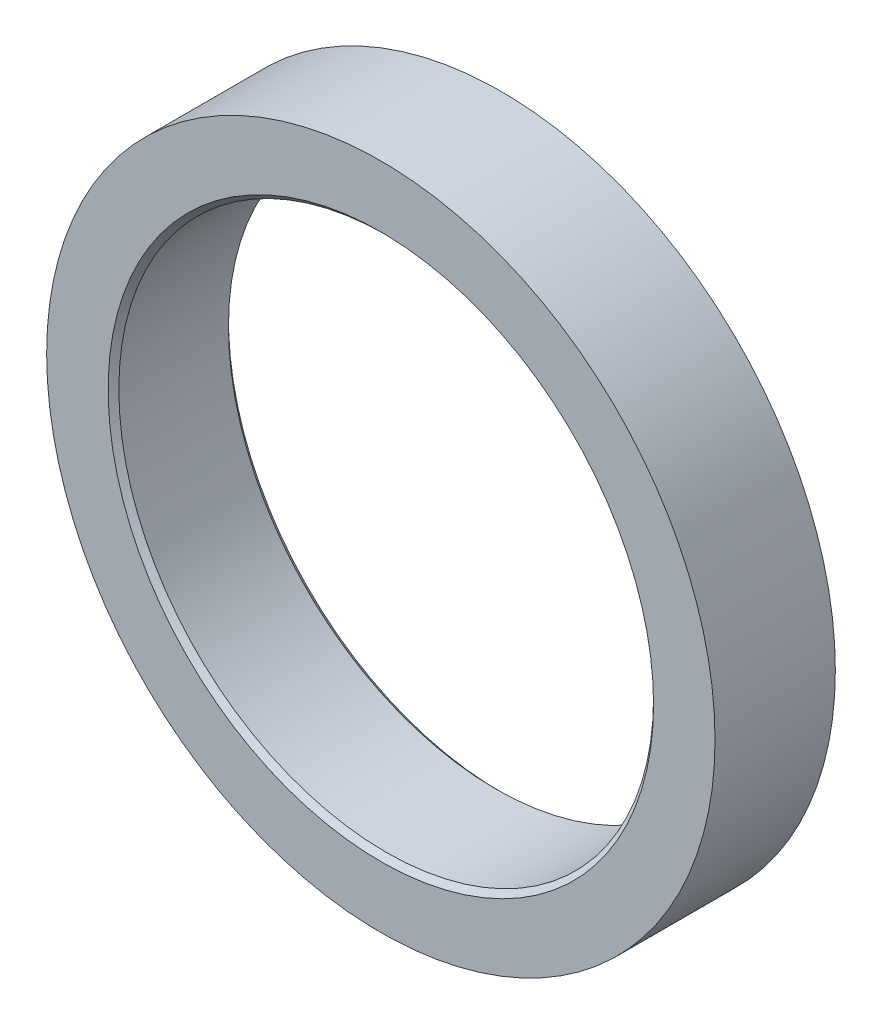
ISO-10303-21;
HEADER;
FILE_DESCRIPTION(('STEP AP214'),'2;1');
FILE_NAME('part.step','',(''),(''),'','','');
FILE_SCHEMA(('AUTOMOTIVE_DESIGN { 1 0 10303 214 1 1 1 1 }'));
ENDSEC;
DATA;
#1=APPLICATION_CONTEXT('core data for automotive mechanical design processes');
#2=APPLICATION_PROTOCOL_DEFINITION('international standard','automotive_design',2000,#1);
#3=PRODUCT_CONTEXT('',#1,'mechanical');
#4=PRODUCT('Part','Part','',(#3));
#5=PRODUCT_RELATED_PRODUCT_CATEGORY('part','',(#4));
#6=PRODUCT_DEFINITION_FORMATION('','',#4);
#7=PRODUCT_DEFINITION_CONTEXT('part definition',#1,'design');
#8=PRODUCT_DEFINITION('design','',#6,#7);
#9=PRODUCT_DEFINITION_SHAPE('','',#8);
#10=(LENGTH_UNIT() NAMED_UNIT(*) SI_UNIT(.MILLI.,.METRE.));
#11=(NAMED_UNIT(*) PLANE_ANGLE_UNIT() SI_UNIT($,.RADIAN.));
#12=(NAMED_UNIT(*) SI_UNIT($,.STERADIAN.) SOLID_ANGLE_UNIT());
#13=UNCERTAINTY_MEASURE_WITH_UNIT(LENGTH_MEASURE(1.E-05),#10,'distance_accuracy_value','');
#14=(GEOMETRIC_REPRESENTATION_CONTEXT(3) GLOBAL_UNCERTAINTY_ASSIGNED_CONTEXT((#13)) GLOBAL_UNIT_ASSIGNED_CONTEXT((#10,
#11,#12)) REPRESENTATION_CONTEXT('',''));
#15=CARTESIAN_POINT('',(0.,0.,0.));
#16=DIRECTION('',(0.,0.,1.));
#17=DIRECTION('',(1.,0.,0.));
#18=AXIS2_PLACEMENT_3D('',#15,#16,#17);
#19=CARTESIAN_POINT('',(0.,0.,4.5));
#20=DIRECTION('',(0.,0.,1.));
#21=DIRECTION('',(1.,0.,0.));
#22=AXIS2_PLACEMENT_3D('',#19,#20,#21);
#23=PLANE('',#22);
#24=CARTESIAN_POINT('',(0.,0.,4.5));
#25=DIRECTION('',(0.,0.,1.));
#26=DIRECTION('',(1.,0.,0.));
#27=AXIS2_PLACEMENT_3D('',#24,#25,#26);
#28=CIRCLE('',#27,10.2);
#29=CARTESIAN_POINT('',(10.2,0.,4.5));
#30=VERTEX_POINT('',#29);
#31=EDGE_CURVE('E10',#30,#30,#28,.F.);
#32=ORIENTED_EDGE('',*,*,#31,.T.);
#33=EDGE_LOOP('',(#32));
#34=FACE_BOUND('',#33,.T.);
#35=CARTESIAN_POINT('',(0.,0.,4.5));
#36=DIRECTION('',(0.,0.,1.));
#37=DIRECTION('',(1.,0.,0.));
#38=AXIS2_PLACEMENT_3D('',#35,#36,#37);
#39=CIRCLE('',#38,12.5);
#40=CARTESIAN_POINT('',(12.5,0.,4.5));
#41=VERTEX_POINT('',#40);
#42=EDGE_CURVE('E370',#41,#41,#39,.T.);
#43=ORIENTED_EDGE('',*,*,#42,.T.);
#44=EDGE_LOOP('',(#43));
#45=FACE_BOUND('',#44,.T.);
#46=ADVANCED_FACE('F350',(#34,#45),#23,.T.);
#47=CARTESIAN_POINT('',(0.,0.,0.));
#48=DIRECTION('',(0.,0.,1.));
#49=DIRECTION('',(1.,0.,0.));
#50=AXIS2_PLACEMENT_3D('',#47,#48,#49);
#51=PLANE('',#50);
#52=CARTESIAN_POINT('',(0.,0.,0.));
#53=DIRECTION('',(0.,0.,1.));
#54=DIRECTION('',(1.,0.,0.));
#55=AXIS2_PLACEMENT_3D('',#52,#53,#54);
#56=CIRCLE('',#55,10.2);
#57=CARTESIAN_POINT('',(10.2,0.,0.));
#58=VERTEX_POINT('',#57);
#59=EDGE_CURVE('E365',#58,#58,#56,.T.);
#60=ORIENTED_EDGE('',*,*,#59,.T.);
#61=EDGE_LOOP('',(#60));
#62=FACE_BOUND('',#61,.T.);
#63=CARTESIAN_POINT('',(0.,0.,0.));
#64=DIRECTION('',(0.,0.,1.));
#65=DIRECTION('',(1.,0.,0.));
#66=AXIS2_PLACEMENT_3D('',#63,#64,#65);
#67=CIRCLE('',#66,12.5);
#68=CARTESIAN_POINT('',(12.5,0.,0.));
#69=VERTEX_POINT('',#68);
#70=EDGE_CURVE('E373',#69,#69,#67,.T.);
#71=ORIENTED_EDGE('',*,*,#70,.F.);
#72=EDGE_LOOP('',(#71));
#73=FACE_BOUND('',#72,.T.);
#74=ADVANCED_FACE('F378',(#62,#73),#51,.F.);
#75=CARTESIAN_POINT('',(0.,0.,4.5));
#76=DIRECTION('',(0.,0.,-1.));
#77=DIRECTION('',(-1.,0.,0.));
#78=AXIS2_PLACEMENT_3D('',#75,#76,#77);
#79=CYLINDRICAL_SURFACE('',#78,12.5);
#80=ORIENTED_EDGE('',*,*,#42,.F.);
#81=EDGE_LOOP('',(#80));
#82=FACE_BOUND('',#81,.T.);
#83=ORIENTED_EDGE('',*,*,#70,.T.);
#84=EDGE_LOOP('',(#83));
#85=FACE_BOUND('',#84,.T.);
#86=ADVANCED_FACE('F352',(#82,#85),#79,.T.);
#87=CARTESIAN_POINT('',(0.,0.,4.5));
#88=DIRECTION('',(0.,0.,-1.));
#89=DIRECTION('',(-1.,0.,0.));
#90=AXIS2_PLACEMENT_3D('',#87,#88,#89);
#91=CYLINDRICAL_SURFACE('',#90,10.);
#92=CARTESIAN_POINT('',(0.,0.,0.200000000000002));
#93=DIRECTION('',(0.,0.,1.));
#94=DIRECTION('',(1.,0.,0.));
#95=AXIS2_PLACEMENT_3D('',#92,#93,#94);
#96=CIRCLE('',#95,10.);
#97=CARTESIAN_POINT('',(10.,0.,0.200000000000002));
#98=VERTEX_POINT('',#97);
#99=EDGE_CURVE('E357',#98,#98,#96,.F.);
#100=ORIENTED_EDGE('',*,*,#99,.T.);
#101=EDGE_LOOP('',(#100));
#102=FACE_BOUND('',#101,.T.);
#103=CARTESIAN_POINT('',(0.,0.,4.3));
#104=DIRECTION('',(0.,0.,1.));
#105=DIRECTION('',(1.,0.,0.));
#106=AXIS2_PLACEMENT_3D('',#103,#104,#105);
#107=CIRCLE('',#106,10.);
#108=CARTESIAN_POINT('',(10.,0.,4.3));
#109=VERTEX_POINT('',#108);
#110=EDGE_CURVE('E361',#109,#109,#107,.T.);
#111=ORIENTED_EDGE('',*,*,#110,.T.);
#112=EDGE_LOOP('',(#111));
#113=FACE_BOUND('',#112,.T.);
#114=ADVANCED_FACE('F387',(#102,#113),#91,.F.);
#115=CARTESIAN_POINT('',(0.,0.,0.));
#116=DIRECTION('',(0.,0.,-1.));
#117=DIRECTION('',(-1.,0.,0.));
#118=AXIS2_PLACEMENT_3D('',#115,#116,#117);
#119=CONICAL_SURFACE('',#118,10.2,0.785398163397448);
#120=ORIENTED_EDGE('',*,*,#99,.F.);
#121=EDGE_LOOP('',(#120));
#122=FACE_BOUND('',#121,.T.);
#123=ORIENTED_EDGE('',*,*,#59,.F.);
#124=EDGE_LOOP('',(#123));
#125=FACE_BOUND('',#124,.T.);
#126=ADVANCED_FACE('F391',(#122,#125),#119,.F.);
#127=CARTESIAN_POINT('',(0.,0.,4.3));
#128=DIRECTION('',(0.,0.,1.));
#129=DIRECTION('',(1.,0.,0.));
#130=AXIS2_PLACEMENT_3D('',#127,#128,#129);
#131=CONICAL_SURFACE('',#130,10.,0.785398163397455);
#132=ORIENTED_EDGE('',*,*,#31,.F.);
#133=EDGE_LOOP('',(#132));
#134=FACE_BOUND('',#133,.T.);
#135=ORIENTED_EDGE('',*,*,#110,.F.);
#136=EDGE_LOOP('',(#135));
#137=FACE_BOUND('',#136,.T.);
#138=ADVANCED_FACE('F394',(#134,#137),#131,.F.);
#139=CLOSED_SHELL('',(#46,#74,#86,#114,#126,#138));
#140=MANIFOLD_SOLID_BREP('B2',#139);
#141=ADVANCED_BREP_SHAPE_REPRESENTATION('',(#18,#140),#14);
#142=SHAPE_DEFINITION_REPRESENTATION(#9,#141);
ENDSEC;
END-ISO-10303-21;
